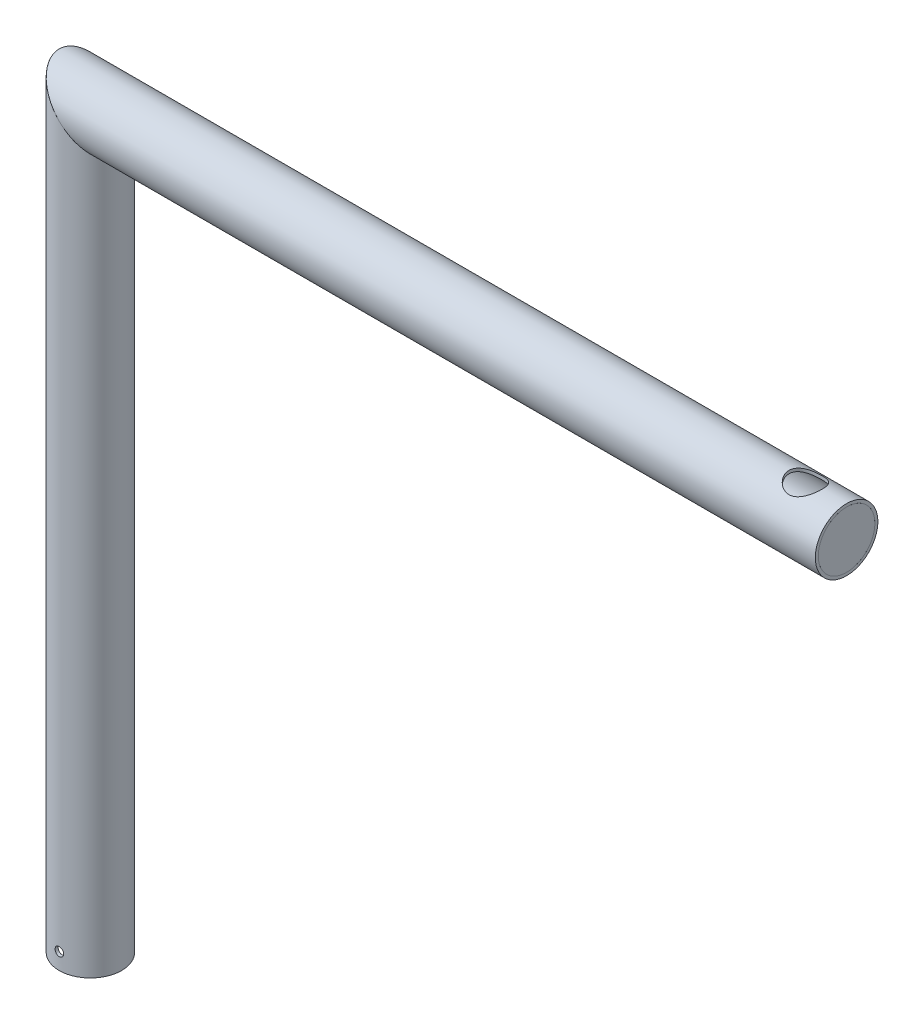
from build123d import *

# Parameters (mm, degrees)
SKIZZE11_R                = 38.05
SKIZZE11_R_2              = 34.45
STRUKTURBAUTEIL1_DEPTH    = 949.760826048
SKIZZE11_ON_SEGMENT_2_R   = 38.05
SKIZZE11_ON_SEGMENT_2_R_2 = 34.45
STRUKTURBAUTEIL1_2_DEPTH  = 974.760826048
SKIZZE12_R                = 34.45
SCHEIBE_ROHR_DEPTH        = 4
SKIZZE13_R                = 5.25
SCHNITT_SPLINT_DEPTH      = 80
SKIZZE14_R                = 20
SCHNITT_ROHR40MM_DEPTH    = 80


with BuildPart() as part:
    # Skizze11 → Strukturbauteil1 (new body)
    with BuildSketch(Plane(origin=(0, 0, 0), x_dir=(1, 0, 0), z_dir=(0, 1, 0))):
        Circle(SKIZZE11_R)
        Circle(SKIZZE11_R_2, mode=Mode.SUBTRACT)
    extrude(amount=STRUKTURBAUTEIL1_DEPTH)

    # Strukturbauteil1 mitre 1
    split(bisect_by=Plane(origin=(0, 894.95, 0), x_dir=(0.707106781, -0.707106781, 0), z_dir=(-0.707106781, -0.707106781, 0)), keep=Keep.TOP)

    # Skizze13 → Schnitt_Splint (cut)
    with BuildSketch(Plane.XY.offset(39)):
        with Locations((0, 20)):
            Circle(SKIZZE13_R)
    extrude(amount=-SCHNITT_SPLINT_DEPTH, mode=Mode.SUBTRACT)


with BuildPart() as body_2:
    # Skizze11 on segment 2 (on carried to segment 2) → Strukturbauteil1 2 (new body)
    with BuildSketch(Plane(origin=(-54.810826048, 894.95, 0), x_dir=(0, -1, 0), z_dir=(1, 0, 0))):
        Circle(SKIZZE11_ON_SEGMENT_2_R)
        Circle(SKIZZE11_ON_SEGMENT_2_R_2, mode=Mode.SUBTRACT)
    extrude(amount=STRUKTURBAUTEIL1_2_DEPTH)

    # Strukturbauteil1 2 mitre 1
    split(bisect_by=Plane(origin=(0, 894.95, 0), x_dir=(-0.707106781, 0.707106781, 0), z_dir=(0.707106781, 0.707106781, 0)), keep=Keep.TOP)

    # Skizze14 → Schnitt_Rohr40mm (cut)
    with BuildSketch(Plane(origin=(0, 933, 0), x_dir=(-1, 0, 0), z_dir=(0, 1, 0))):
        with Locations(Location((-869.95, 0, 0), (0, 0, 90))):
            Circle(SKIZZE14_R)
    extrude(amount=-SCHNITT_ROHR40MM_DEPTH, mode=Mode.SUBTRACT)


with BuildPart() as body_3:
    # Skizze12 → Scheibe_Rohr (new body)
    with BuildSketch(Plane(origin=(919.95, 0, 0), x_dir=(0, 0, -1), z_dir=(1, 0, 0))):
        with Locations((0, 894.95)):
            Circle(SKIZZE12_R)
    extrude(amount=-SCHEIBE_ROHR_DEPTH)


solid = Compound([part.part, body_2.part, body_3.part])
